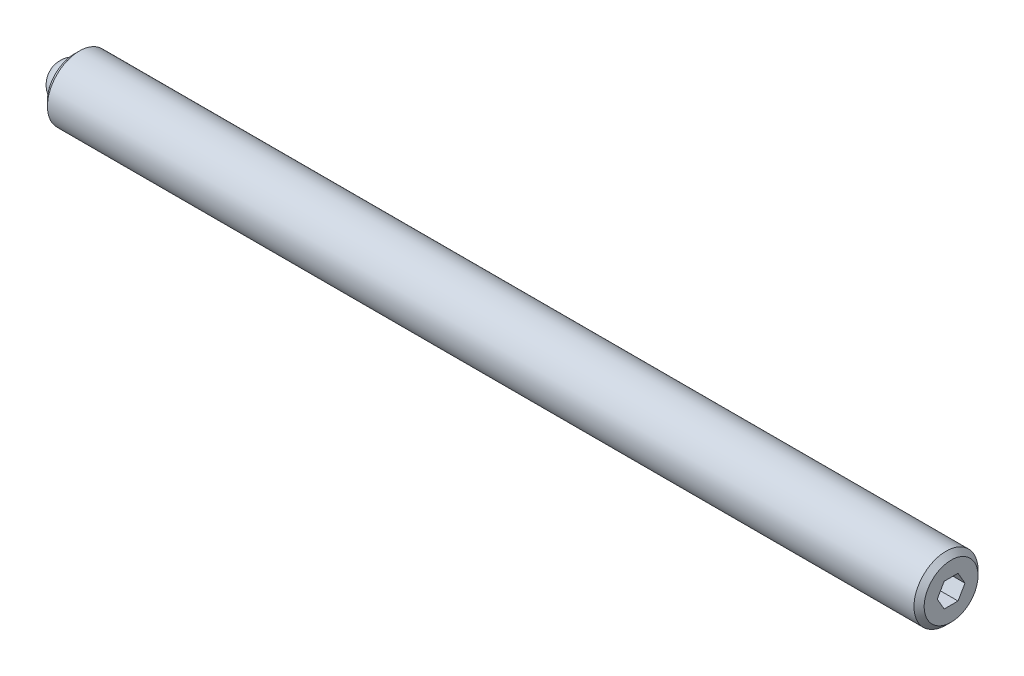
ISO-10303-21;
HEADER;
FILE_DESCRIPTION(('STEP AP214'),'2;1');
FILE_NAME('part.step','',(''),(''),'','','');
FILE_SCHEMA(('AUTOMOTIVE_DESIGN { 1 0 10303 214 1 1 1 1 }'));
ENDSEC;
DATA;
#1=APPLICATION_CONTEXT('core data for automotive mechanical design processes');
#2=APPLICATION_PROTOCOL_DEFINITION('international standard','automotive_design',2000,#1);
#3=PRODUCT_CONTEXT('',#1,'mechanical');
#4=PRODUCT('Part','Part','',(#3));
#5=PRODUCT_RELATED_PRODUCT_CATEGORY('part','',(#4));
#6=PRODUCT_DEFINITION_FORMATION('','',#4);
#7=PRODUCT_DEFINITION_CONTEXT('part definition',#1,'design');
#8=PRODUCT_DEFINITION('design','',#6,#7);
#9=PRODUCT_DEFINITION_SHAPE('','',#8);
#10=(LENGTH_UNIT() NAMED_UNIT(*) SI_UNIT(.MILLI.,.METRE.));
#11=(NAMED_UNIT(*) PLANE_ANGLE_UNIT() SI_UNIT($,.RADIAN.));
#12=(NAMED_UNIT(*) SI_UNIT($,.STERADIAN.) SOLID_ANGLE_UNIT());
#13=UNCERTAINTY_MEASURE_WITH_UNIT(LENGTH_MEASURE(1.E-05),#10,'distance_accuracy_value','');
#14=(GEOMETRIC_REPRESENTATION_CONTEXT(3) GLOBAL_UNCERTAINTY_ASSIGNED_CONTEXT((#13)) GLOBAL_UNIT_ASSIGNED_CONTEXT((#10,
#11,#12)) REPRESENTATION_CONTEXT('',''));
#15=CARTESIAN_POINT('',(0.,0.,0.));
#16=DIRECTION('',(0.,0.,1.));
#17=DIRECTION('',(1.,0.,0.));
#18=AXIS2_PLACEMENT_3D('',#15,#16,#17);
#19=CARTESIAN_POINT('',(0.,0.,0.));
#20=DIRECTION('',(0.,-1.,0.));
#21=DIRECTION('',(0.,0.,1.));
#22=AXIS2_PLACEMENT_3D('',#19,#20,#21);
#23=SPHERICAL_SURFACE('',#22,1.984375);
#24=CARTESIAN_POINT('',(0.,-1.984375,0.));
#25=VERTEX_POINT('',#24);
#26=VERTEX_LOOP('',#25);
#27=FACE_BOUND('',#26,.T.);
#28=ADVANCED_FACE('F41',(#27),#23,.T.);
#29=CLOSED_SHELL('',(#28));
#30=MANIFOLD_SOLID_BREP('B2',#29);
#31=CARTESIAN_POINT('',(86.915625,0.,0.));
#32=DIRECTION('',(-1.,0.,0.));
#33=DIRECTION('',(0.,0.,1.));
#34=AXIS2_PLACEMENT_3D('',#31,#32,#33);
#35=CYLINDRICAL_SURFACE('',#34,3.175);
#36=CARTESIAN_POINT('',(86.407625,0.,0.));
#37=DIRECTION('',(1.,0.,0.));
#38=DIRECTION('',(0.,0.,-1.));
#39=AXIS2_PLACEMENT_3D('',#36,#37,#38);
#40=CIRCLE('',#39,3.175);
#41=CARTESIAN_POINT('',(86.407625,0.,-3.175));
#42=VERTEX_POINT('',#41);
#43=EDGE_CURVE('E39',#42,#42,#40,.F.);
#44=ORIENTED_EDGE('',*,*,#43,.T.);
#45=EDGE_LOOP('',(#44));
#46=FACE_BOUND('',#45,.T.);
#47=CARTESIAN_POINT('',(0.507999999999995,0.,0.));
#48=DIRECTION('',(1.,0.,0.));
#49=DIRECTION('',(0.,0.,-1.));
#50=AXIS2_PLACEMENT_3D('',#47,#48,#49);
#51=CIRCLE('',#50,3.175);
#52=CARTESIAN_POINT('',(0.507999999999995,0.,-3.175));
#53=VERTEX_POINT('',#52);
#54=EDGE_CURVE('E157',#53,#53,#51,.T.);
#55=ORIENTED_EDGE('',*,*,#54,.T.);
#56=EDGE_LOOP('',(#55));
#57=FACE_BOUND('',#56,.T.);
#58=ADVANCED_FACE('F54',(#46,#57),#35,.T.);
#59=CARTESIAN_POINT('',(86.915625,0.,0.));
#60=DIRECTION('',(1.,0.,0.));
#61=DIRECTION('',(0.,0.,-1.));
#62=AXIS2_PLACEMENT_3D('',#59,#60,#61);
#63=PLANE('',#62);
#64=DIRECTION('',(0.,0.866025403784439,-0.5));
#65=VECTOR('',#64,1.);
#66=CARTESIAN_POINT('',(86.915625,-1.190625,-0.687407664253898));
#67=LINE('',#66,#65);
#68=CARTESIAN_POINT('',(86.915625,-1.190625,-0.687407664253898));
#69=VERTEX_POINT('',#68);
#70=CARTESIAN_POINT('',(86.915625,0.,-1.3748153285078));
#71=VERTEX_POINT('',#70);
#72=EDGE_CURVE('E69',#69,#71,#67,.T.);
#73=ORIENTED_EDGE('',*,*,#72,.F.);
#74=DIRECTION('',(0.,0.,-1.));
#75=VECTOR('',#74,1.);
#76=CARTESIAN_POINT('',(86.915625,-1.190625,0.687407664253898));
#77=LINE('',#76,#75);
#78=CARTESIAN_POINT('',(86.915625,-1.190625,0.687407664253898));
#79=VERTEX_POINT('',#78);
#80=EDGE_CURVE('E153',#79,#69,#77,.T.);
#81=ORIENTED_EDGE('',*,*,#80,.F.);
#82=DIRECTION('',(0.,-0.866025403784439,-0.5));
#83=VECTOR('',#82,1.);
#84=CARTESIAN_POINT('',(86.915625,0.,1.3748153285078));
#85=LINE('',#84,#83);
#86=CARTESIAN_POINT('',(86.915625,0.,1.3748153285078));
#87=VERTEX_POINT('',#86);
#88=EDGE_CURVE('E151',#87,#79,#85,.T.);
#89=ORIENTED_EDGE('',*,*,#88,.F.);
#90=DIRECTION('',(0.,-0.866025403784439,0.5));
#91=VECTOR('',#90,1.);
#92=CARTESIAN_POINT('',(86.915625,1.190625,0.687407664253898));
#93=LINE('',#92,#91);
#94=CARTESIAN_POINT('',(86.915625,1.190625,0.687407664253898));
#95=VERTEX_POINT('',#94);
#96=EDGE_CURVE('E117',#95,#87,#93,.T.);
#97=ORIENTED_EDGE('',*,*,#96,.F.);
#98=DIRECTION('',(0.,0.,1.));
#99=VECTOR('',#98,1.);
#100=CARTESIAN_POINT('',(86.915625,1.190625,-0.687407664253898));
#101=LINE('',#100,#99);
#102=CARTESIAN_POINT('',(86.915625,1.190625,-0.687407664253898));
#103=VERTEX_POINT('',#102);
#104=EDGE_CURVE('E147',#103,#95,#101,.T.);
#105=ORIENTED_EDGE('',*,*,#104,.F.);
#106=DIRECTION('',(0.,0.866025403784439,0.5));
#107=VECTOR('',#106,1.);
#108=CARTESIAN_POINT('',(86.915625,0.,-1.3748153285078));
#109=LINE('',#108,#107);
#110=EDGE_CURVE('E143',#71,#103,#109,.T.);
#111=ORIENTED_EDGE('',*,*,#110,.F.);
#112=EDGE_LOOP('',(#73,#81,#89,#97,#105,#111));
#113=FACE_BOUND('',#112,.T.);
#114=CARTESIAN_POINT('',(86.915625,0.,0.));
#115=DIRECTION('',(1.,0.,0.));
#116=DIRECTION('',(0.,0.,-1.));
#117=AXIS2_PLACEMENT_3D('',#114,#115,#116);
#118=CIRCLE('',#117,2.66699999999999);
#119=CARTESIAN_POINT('',(86.915625,0.,-2.66699999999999));
#120=VERTEX_POINT('',#119);
#121=EDGE_CURVE('E62',#120,#120,#118,.T.);
#122=ORIENTED_EDGE('',*,*,#121,.T.);
#123=EDGE_LOOP('',(#122));
#124=FACE_BOUND('',#123,.T.);
#125=ADVANCED_FACE('F170',(#113,#124),#63,.T.);
#126=CARTESIAN_POINT('',(0.,0.,0.));
#127=DIRECTION('',(1.,0.,0.));
#128=DIRECTION('',(0.,0.,-1.));
#129=AXIS2_PLACEMENT_3D('',#126,#127,#128);
#130=PLANE('',#129);
#131=CARTESIAN_POINT('',(0.,0.,0.));
#132=DIRECTION('',(-1.,0.,0.));
#133=DIRECTION('',(0.,0.,1.));
#134=AXIS2_PLACEMENT_3D('',#131,#132,#133);
#135=CIRCLE('',#134,1.9812);
#136=CARTESIAN_POINT('',(0.,0.,1.9812));
#137=VERTEX_POINT('',#136);
#138=EDGE_CURVE('E225',#137,#137,#135,.T.);
#139=ORIENTED_EDGE('',*,*,#138,.F.);
#140=EDGE_LOOP('',(#139));
#141=FACE_BOUND('',#140,.T.);
#142=CARTESIAN_POINT('',(0.,0.,0.));
#143=DIRECTION('',(1.,0.,0.));
#144=DIRECTION('',(0.,0.,-1.));
#145=AXIS2_PLACEMENT_3D('',#142,#143,#144);
#146=CIRCLE('',#145,2.66700000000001);
#147=CARTESIAN_POINT('',(0.,0.,-2.66700000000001));
#148=VERTEX_POINT('',#147);
#149=EDGE_CURVE('E165',#148,#148,#146,.F.);
#150=ORIENTED_EDGE('',*,*,#149,.T.);
#151=EDGE_LOOP('',(#150));
#152=FACE_BOUND('',#151,.T.);
#153=ADVANCED_FACE('F182',(#141,#152),#130,.F.);
#154=CARTESIAN_POINT('',(0.507999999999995,0.,0.));
#155=DIRECTION('',(1.,0.,0.));
#156=DIRECTION('',(0.,0.,-1.));
#157=AXIS2_PLACEMENT_3D('',#154,#155,#156);
#158=CONICAL_SURFACE('',#157,3.175,0.785398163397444);
#159=ORIENTED_EDGE('',*,*,#149,.F.);
#160=EDGE_LOOP('',(#159));
#161=FACE_BOUND('',#160,.T.);
#162=ORIENTED_EDGE('',*,*,#54,.F.);
#163=EDGE_LOOP('',(#162));
#164=FACE_BOUND('',#163,.T.);
#165=ADVANCED_FACE('F174',(#161,#164),#158,.T.);
#166=CARTESIAN_POINT('',(86.915625,0.,0.));
#167=DIRECTION('',(-1.,0.,0.));
#168=DIRECTION('',(0.,0.,1.));
#169=AXIS2_PLACEMENT_3D('',#166,#167,#168);
#170=CONICAL_SURFACE('',#169,2.66699999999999,0.785398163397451);
#171=ORIENTED_EDGE('',*,*,#43,.F.);
#172=EDGE_LOOP('',(#171));
#173=FACE_BOUND('',#172,.T.);
#174=ORIENTED_EDGE('',*,*,#121,.F.);
#175=EDGE_LOOP('',(#174));
#176=FACE_BOUND('',#175,.T.);
#177=ADVANCED_FACE('F56',(#173,#176),#170,.T.);
#178=CARTESIAN_POINT('',(84.629625,-1.190625,-0.687407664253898));
#179=DIRECTION('',(0.,-0.5,-0.866025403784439));
#180=DIRECTION('',(0.,0.866025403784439,-0.5));
#181=AXIS2_PLACEMENT_3D('',#178,#179,#180);
#182=PLANE('',#181);
#183=ORIENTED_EDGE('',*,*,#72,.T.);
#184=DIRECTION('',(1.,0.,0.));
#185=VECTOR('',#184,1.);
#186=CARTESIAN_POINT('',(84.629625,0.,-1.3748153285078));
#187=LINE('',#186,#185);
#188=CARTESIAN_POINT('',(84.629625,0.,-1.3748153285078));
#189=VERTEX_POINT('',#188);
#190=EDGE_CURVE('E99',#189,#71,#187,.T.);
#191=ORIENTED_EDGE('',*,*,#190,.F.);
#192=DIRECTION('',(0.,0.866025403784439,-0.5));
#193=VECTOR('',#192,1.);
#194=CARTESIAN_POINT('',(84.629625,-1.190625,-0.687407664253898));
#195=LINE('',#194,#193);
#196=CARTESIAN_POINT('',(84.629625,-1.190625,-0.687407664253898));
#197=VERTEX_POINT('',#196);
#198=EDGE_CURVE('E155',#197,#189,#195,.T.);
#199=ORIENTED_EDGE('',*,*,#198,.F.);
#200=DIRECTION('',(1.,0.,0.));
#201=VECTOR('',#200,1.);
#202=CARTESIAN_POINT('',(84.629625,-1.190625,-0.687407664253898));
#203=LINE('',#202,#201);
#204=EDGE_CURVE('E77',#197,#69,#203,.T.);
#205=ORIENTED_EDGE('',*,*,#204,.T.);
#206=EDGE_LOOP('',(#183,#191,#199,#205));
#207=FACE_BOUND('',#206,.T.);
#208=ADVANCED_FACE('F173',(#207),#182,.F.);
#209=CARTESIAN_POINT('',(84.629625,-1.190625,0.687407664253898));
#210=DIRECTION('',(0.,-1.,0.));
#211=DIRECTION('',(0.,0.,-1.));
#212=AXIS2_PLACEMENT_3D('',#209,#210,#211);
#213=PLANE('',#212);
#214=ORIENTED_EDGE('',*,*,#80,.T.);
#215=ORIENTED_EDGE('',*,*,#204,.F.);
#216=DIRECTION('',(0.,0.,-1.));
#217=VECTOR('',#216,1.);
#218=CARTESIAN_POINT('',(84.629625,-1.190625,0.687407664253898));
#219=LINE('',#218,#217);
#220=CARTESIAN_POINT('',(84.629625,-1.190625,0.687407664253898));
#221=VERTEX_POINT('',#220);
#222=EDGE_CURVE('E129',#221,#197,#219,.T.);
#223=ORIENTED_EDGE('',*,*,#222,.F.);
#224=DIRECTION('',(1.,0.,0.));
#225=VECTOR('',#224,1.);
#226=CARTESIAN_POINT('',(84.629625,-1.190625,0.687407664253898));
#227=LINE('',#226,#225);
#228=EDGE_CURVE('E121',#221,#79,#227,.T.);
#229=ORIENTED_EDGE('',*,*,#228,.T.);
#230=EDGE_LOOP('',(#214,#215,#223,#229));
#231=FACE_BOUND('',#230,.T.);
#232=ADVANCED_FACE('F180',(#231),#213,.F.);
#233=CARTESIAN_POINT('',(84.629625,0.,1.3748153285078));
#234=DIRECTION('',(0.,-0.5,0.866025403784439));
#235=DIRECTION('',(0.,-0.866025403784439,-0.5));
#236=AXIS2_PLACEMENT_3D('',#233,#234,#235);
#237=PLANE('',#236);
#238=ORIENTED_EDGE('',*,*,#88,.T.);
#239=ORIENTED_EDGE('',*,*,#228,.F.);
#240=DIRECTION('',(0.,-0.866025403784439,-0.5));
#241=VECTOR('',#240,1.);
#242=CARTESIAN_POINT('',(84.629625,0.,1.3748153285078));
#243=LINE('',#242,#241);
#244=CARTESIAN_POINT('',(84.629625,0.,1.3748153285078));
#245=VERTEX_POINT('',#244);
#246=EDGE_CURVE('E125',#245,#221,#243,.T.);
#247=ORIENTED_EDGE('',*,*,#246,.F.);
#248=DIRECTION('',(1.,0.,0.));
#249=VECTOR('',#248,1.);
#250=CARTESIAN_POINT('',(84.629625,0.,1.3748153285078));
#251=LINE('',#250,#249);
#252=EDGE_CURVE('E110',#245,#87,#251,.T.);
#253=ORIENTED_EDGE('',*,*,#252,.T.);
#254=EDGE_LOOP('',(#238,#239,#247,#253));
#255=FACE_BOUND('',#254,.T.);
#256=ADVANCED_FACE('F126',(#255),#237,.F.);
#257=CARTESIAN_POINT('',(84.629625,1.190625,0.687407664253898));
#258=DIRECTION('',(0.,0.5,0.866025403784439));
#259=DIRECTION('',(0.,-0.866025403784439,0.5));
#260=AXIS2_PLACEMENT_3D('',#257,#258,#259);
#261=PLANE('',#260);
#262=ORIENTED_EDGE('',*,*,#96,.T.);
#263=ORIENTED_EDGE('',*,*,#252,.F.);
#264=DIRECTION('',(0.,-0.866025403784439,0.5));
#265=VECTOR('',#264,1.);
#266=CARTESIAN_POINT('',(84.629625,1.190625,0.687407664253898));
#267=LINE('',#266,#265);
#268=CARTESIAN_POINT('',(84.629625,1.190625,0.687407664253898));
#269=VERTEX_POINT('',#268);
#270=EDGE_CURVE('E114',#269,#245,#267,.T.);
#271=ORIENTED_EDGE('',*,*,#270,.F.);
#272=DIRECTION('',(1.,0.,0.));
#273=VECTOR('',#272,1.);
#274=CARTESIAN_POINT('',(84.629625,1.190625,0.687407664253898));
#275=LINE('',#274,#273);
#276=EDGE_CURVE('E122',#269,#95,#275,.T.);
#277=ORIENTED_EDGE('',*,*,#276,.T.);
#278=EDGE_LOOP('',(#262,#263,#271,#277));
#279=FACE_BOUND('',#278,.T.);
#280=ADVANCED_FACE('F112',(#279),#261,.F.);
#281=CARTESIAN_POINT('',(84.629625,1.190625,-0.687407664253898));
#282=DIRECTION('',(0.,1.,0.));
#283=DIRECTION('',(0.,0.,1.));
#284=AXIS2_PLACEMENT_3D('',#281,#282,#283);
#285=PLANE('',#284);
#286=ORIENTED_EDGE('',*,*,#104,.T.);
#287=ORIENTED_EDGE('',*,*,#276,.F.);
#288=DIRECTION('',(0.,0.,1.));
#289=VECTOR('',#288,1.);
#290=CARTESIAN_POINT('',(84.629625,1.190625,-0.687407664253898));
#291=LINE('',#290,#289);
#292=CARTESIAN_POINT('',(84.629625,1.190625,-0.687407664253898));
#293=VERTEX_POINT('',#292);
#294=EDGE_CURVE('E135',#293,#269,#291,.T.);
#295=ORIENTED_EDGE('',*,*,#294,.F.);
#296=DIRECTION('',(1.,0.,0.));
#297=VECTOR('',#296,1.);
#298=CARTESIAN_POINT('',(84.629625,1.190625,-0.687407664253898));
#299=LINE('',#298,#297);
#300=EDGE_CURVE('E160',#293,#103,#299,.T.);
#301=ORIENTED_EDGE('',*,*,#300,.T.);
#302=EDGE_LOOP('',(#286,#287,#295,#301));
#303=FACE_BOUND('',#302,.T.);
#304=ADVANCED_FACE('F201',(#303),#285,.F.);
#305=CARTESIAN_POINT('',(84.629625,0.,-1.3748153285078));
#306=DIRECTION('',(0.,0.5,-0.866025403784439));
#307=DIRECTION('',(0.,0.866025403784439,0.5));
#308=AXIS2_PLACEMENT_3D('',#305,#306,#307);
#309=PLANE('',#308);
#310=ORIENTED_EDGE('',*,*,#110,.T.);
#311=ORIENTED_EDGE('',*,*,#300,.F.);
#312=DIRECTION('',(0.,0.866025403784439,0.5));
#313=VECTOR('',#312,1.);
#314=CARTESIAN_POINT('',(84.629625,0.,-1.3748153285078));
#315=LINE('',#314,#313);
#316=EDGE_CURVE('E137',#189,#293,#315,.T.);
#317=ORIENTED_EDGE('',*,*,#316,.F.);
#318=ORIENTED_EDGE('',*,*,#190,.T.);
#319=EDGE_LOOP('',(#310,#311,#317,#318));
#320=FACE_BOUND('',#319,.T.);
#321=ADVANCED_FACE('F198',(#320),#309,.F.);
#322=CARTESIAN_POINT('',(84.629625,0.,0.));
#323=DIRECTION('',(1.,0.,0.));
#324=DIRECTION('',(0.,0.,-1.));
#325=AXIS2_PLACEMENT_3D('',#322,#323,#324);
#326=PLANE('',#325);
#327=ORIENTED_EDGE('',*,*,#198,.T.);
#328=ORIENTED_EDGE('',*,*,#316,.T.);
#329=ORIENTED_EDGE('',*,*,#294,.T.);
#330=ORIENTED_EDGE('',*,*,#270,.T.);
#331=ORIENTED_EDGE('',*,*,#246,.T.);
#332=ORIENTED_EDGE('',*,*,#222,.T.);
#333=EDGE_LOOP('',(#327,#328,#329,#330,#331,#332));
#334=FACE_BOUND('',#333,.T.);
#335=ADVANCED_FACE('F132',(#334),#326,.T.);
#336=CARTESIAN_POINT('',(1.984375,0.,0.));
#337=DIRECTION('',(-1.,0.,0.));
#338=DIRECTION('',(0.,0.,1.));
#339=AXIS2_PLACEMENT_3D('',#336,#337,#338);
#340=CYLINDRICAL_SURFACE('',#339,1.9812);
#341=CARTESIAN_POINT('',(1.984375,0.,0.));
#342=DIRECTION('',(-1.,0.,0.));
#343=DIRECTION('',(0.,0.,1.));
#344=AXIS2_PLACEMENT_3D('',#341,#342,#343);
#345=CIRCLE('',#344,1.9812);
#346=CARTESIAN_POINT('',(1.984375,0.,1.9812));
#347=VERTEX_POINT('',#346);
#348=EDGE_CURVE('E144',#347,#347,#345,.T.);
#349=ORIENTED_EDGE('',*,*,#348,.F.);
#350=EDGE_LOOP('',(#349));
#351=FACE_BOUND('',#350,.T.);
#352=ORIENTED_EDGE('',*,*,#138,.T.);
#353=EDGE_LOOP('',(#352));
#354=FACE_BOUND('',#353,.T.);
#355=ADVANCED_FACE('F214',(#351,#354),#340,.F.);
#356=CARTESIAN_POINT('',(1.984375,0.,0.));
#357=DIRECTION('',(-1.,0.,0.));
#358=DIRECTION('',(0.,0.,1.));
#359=AXIS2_PLACEMENT_3D('',#356,#357,#358);
#360=PLANE('',#359);
#361=ORIENTED_EDGE('',*,*,#348,.T.);
#362=EDGE_LOOP('',(#361));
#363=FACE_BOUND('',#362,.T.);
#364=ADVANCED_FACE('F217',(#363),#360,.T.);
#365=CLOSED_SHELL('',(#58,#125,#153,#165,#177,#208,#232,#256,#280,#304,#321,#335,#355,#364));
#366=MANIFOLD_SOLID_BREP('B6',#365);
#367=ADVANCED_BREP_SHAPE_REPRESENTATION('',(#18,#30,#366),#14);
#368=SHAPE_DEFINITION_REPRESENTATION(#9,#367);
ENDSEC;
END-ISO-10303-21;
